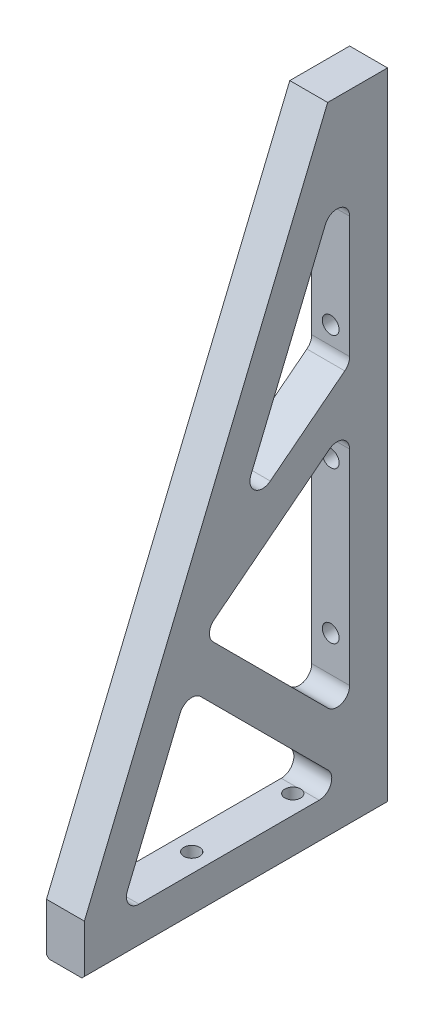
ISO-10303-21;
HEADER;
FILE_DESCRIPTION(('STEP AP214'),'2;1');
FILE_NAME('part.step','',(''),(''),'','','');
FILE_SCHEMA(('AUTOMOTIVE_DESIGN { 1 0 10303 214 1 1 1 1 }'));
ENDSEC;
DATA;
#1=APPLICATION_CONTEXT('core data for automotive mechanical design processes');
#2=APPLICATION_PROTOCOL_DEFINITION('international standard','automotive_design',2000,#1);
#3=PRODUCT_CONTEXT('',#1,'mechanical');
#4=PRODUCT('Part','Part','',(#3));
#5=PRODUCT_RELATED_PRODUCT_CATEGORY('part','',(#4));
#6=PRODUCT_DEFINITION_FORMATION('','',#4);
#7=PRODUCT_DEFINITION_CONTEXT('part definition',#1,'design');
#8=PRODUCT_DEFINITION('design','',#6,#7);
#9=PRODUCT_DEFINITION_SHAPE('','',#8);
#10=(LENGTH_UNIT() NAMED_UNIT(*) SI_UNIT(.MILLI.,.METRE.));
#11=(NAMED_UNIT(*) PLANE_ANGLE_UNIT() SI_UNIT($,.RADIAN.));
#12=(NAMED_UNIT(*) SI_UNIT($,.STERADIAN.) SOLID_ANGLE_UNIT());
#13=UNCERTAINTY_MEASURE_WITH_UNIT(LENGTH_MEASURE(1.E-05),#10,'distance_accuracy_value','');
#14=(GEOMETRIC_REPRESENTATION_CONTEXT(3) GLOBAL_UNCERTAINTY_ASSIGNED_CONTEXT((#13)) GLOBAL_UNIT_ASSIGNED_CONTEXT((#10,
#11,#12)) REPRESENTATION_CONTEXT('',''));
#15=CARTESIAN_POINT('',(0.,0.,0.));
#16=DIRECTION('',(0.,0.,1.));
#17=DIRECTION('',(1.,0.,0.));
#18=AXIS2_PLACEMENT_3D('',#15,#16,#17);
#19=CARTESIAN_POINT('',(9.52499999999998,25.3999999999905,139.7));
#20=DIRECTION('',(0.,-1.,0.));
#21=DIRECTION('',(0.,0.,-1.));
#22=AXIS2_PLACEMENT_3D('',#19,#20,#21);
#23=CONICAL_SURFACE('',#22,3.96874999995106,1.02974425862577);
#24=CARTESIAN_POINT('',(9.52499999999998,27.7846655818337,139.700000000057));
#25=VERTEX_POINT('',#24);
#26=VERTEX_LOOP('',#25);
#27=FACE_BOUND('',#26,.T.);
#28=CARTESIAN_POINT('',(9.52499999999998,25.4,139.7));
#29=DIRECTION('',(0.,-1.,0.));
#30=DIRECTION('',(0.,0.,-1.));
#31=AXIS2_PLACEMENT_3D('',#28,#29,#30);
#32=CIRCLE('',#31,3.96874999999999);
#33=CARTESIAN_POINT('',(9.52499999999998,25.4,135.73125));
#34=VERTEX_POINT('',#33);
#35=EDGE_CURVE('E244',#34,#34,#32,.T.);
#36=ORIENTED_EDGE('',*,*,#35,.T.);
#37=EDGE_LOOP('',(#36));
#38=FACE_BOUND('',#37,.T.);
#39=ADVANCED_FACE('F16',(#27,#38),#23,.F.);
#40=CARTESIAN_POINT('',(9.52499999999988,289.860909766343,22.2249999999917));
#41=DIRECTION('',(0.,0.,-1.));
#42=DIRECTION('',(-1.,0.,0.));
#43=AXIS2_PLACEMENT_3D('',#40,#41,#42);
#44=CONICAL_SURFACE('',#43,4.21640000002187,1.02974425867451);
#45=CARTESIAN_POINT('',(9.52499999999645,289.860909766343,24.7584687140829));
#46=VERTEX_POINT('',#45);
#47=VERTEX_LOOP('',#46);
#48=FACE_BOUND('',#47,.T.);
#49=CARTESIAN_POINT('',(9.52499999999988,289.860909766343,22.225));
#50=DIRECTION('',(0.,0.,-1.));
#51=DIRECTION('',(-1.,0.,0.));
#52=AXIS2_PLACEMENT_3D('',#49,#50,#51);
#53=CIRCLE('',#52,4.21639999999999);
#54=CARTESIAN_POINT('',(5.30859999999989,289.860909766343,22.225));
#55=VERTEX_POINT('',#54);
#56=EDGE_CURVE('E241',#55,#55,#53,.T.);
#57=ORIENTED_EDGE('',*,*,#56,.T.);
#58=EDGE_LOOP('',(#57));
#59=FACE_BOUND('',#58,.T.);
#60=ADVANCED_FACE('F614',(#48,#59),#44,.F.);
#61=CARTESIAN_POINT('',(9.52499999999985,9.52500000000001,22.2249999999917));
#62=DIRECTION('',(0.,0.,-1.));
#63=DIRECTION('',(-1.,0.,0.));
#64=AXIS2_PLACEMENT_3D('',#61,#62,#63);
#65=CONICAL_SURFACE('',#64,4.21640000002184,1.02974425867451);
#66=CARTESIAN_POINT('',(9.52499999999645,9.52500000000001,24.7584687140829));
#67=VERTEX_POINT('',#66);
#68=VERTEX_LOOP('',#67);
#69=FACE_BOUND('',#68,.T.);
#70=CARTESIAN_POINT('',(9.52499999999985,9.52500000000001,22.225));
#71=DIRECTION('',(0.,0.,-1.));
#72=DIRECTION('',(-1.,0.,0.));
#73=AXIS2_PLACEMENT_3D('',#70,#71,#72);
#74=CIRCLE('',#73,4.21639999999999);
#75=CARTESIAN_POINT('',(5.30859999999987,9.52500000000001,22.225));
#76=VERTEX_POINT('',#75);
#77=EDGE_CURVE('E238',#76,#76,#74,.T.);
#78=ORIENTED_EDGE('',*,*,#77,.T.);
#79=EDGE_LOOP('',(#78));
#80=FACE_BOUND('',#79,.T.);
#81=ADVANCED_FACE('F606',(#69,#80),#65,.F.);
#82=CARTESIAN_POINT('',(9.52499999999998,0.,139.7));
#83=DIRECTION('',(0.,-1.,0.));
#84=DIRECTION('',(0.,0.,-1.));
#85=AXIS2_PLACEMENT_3D('',#82,#83,#84);
#86=CYLINDRICAL_SURFACE('',#85,3.96874999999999);
#87=ORIENTED_EDGE('',*,*,#35,.F.);
#88=EDGE_LOOP('',(#87));
#89=FACE_BOUND('',#88,.T.);
#90=CARTESIAN_POINT('',(9.52499999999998,0.,139.7));
#91=DIRECTION('',(0.,-1.,0.));
#92=DIRECTION('',(0.,0.,-1.));
#93=AXIS2_PLACEMENT_3D('',#90,#91,#92);
#94=CIRCLE('',#93,3.96874999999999);
#95=CARTESIAN_POINT('',(9.52499999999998,0.,135.73125));
#96=VERTEX_POINT('',#95);
#97=EDGE_CURVE('E19',#96,#96,#94,.T.);
#98=ORIENTED_EDGE('',*,*,#97,.T.);
#99=EDGE_LOOP('',(#98));
#100=FACE_BOUND('',#99,.T.);
#101=ADVANCED_FACE('F603',(#89,#100),#86,.F.);
#102=CARTESIAN_POINT('',(9.52499999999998,0.,88.9));
#103=DIRECTION('',(0.,-1.,0.));
#104=DIRECTION('',(0.,0.,-1.));
#105=AXIS2_PLACEMENT_3D('',#102,#103,#104);
#106=CYLINDRICAL_SURFACE('',#105,3.96874999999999);
#107=CARTESIAN_POINT('',(9.52499999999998,19.05,88.9));
#108=DIRECTION('',(0.,-1.,0.));
#109=DIRECTION('',(0.,0.,-1.));
#110=AXIS2_PLACEMENT_3D('',#107,#108,#109);
#111=CIRCLE('',#110,3.96874999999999);
#112=CARTESIAN_POINT('',(9.52499999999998,19.05,84.93125));
#113=VERTEX_POINT('',#112);
#114=EDGE_CURVE('E225',#113,#113,#111,.F.);
#115=ORIENTED_EDGE('',*,*,#114,.T.);
#116=EDGE_LOOP('',(#115));
#117=FACE_BOUND('',#116,.T.);
#118=CARTESIAN_POINT('',(9.52499999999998,0.,88.9));
#119=DIRECTION('',(0.,-1.,0.));
#120=DIRECTION('',(0.,0.,-1.));
#121=AXIS2_PLACEMENT_3D('',#118,#119,#120);
#122=CIRCLE('',#121,3.96874999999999);
#123=CARTESIAN_POINT('',(9.52499999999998,0.,84.93125));
#124=VERTEX_POINT('',#123);
#125=EDGE_CURVE('E596',#124,#124,#122,.T.);
#126=ORIENTED_EDGE('',*,*,#125,.T.);
#127=EDGE_LOOP('',(#126));
#128=FACE_BOUND('',#127,.T.);
#129=ADVANCED_FACE('F385',(#117,#128),#106,.F.);
#130=CARTESIAN_POINT('',(9.52499999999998,0.,38.1));
#131=DIRECTION('',(0.,-1.,0.));
#132=DIRECTION('',(0.,0.,-1.));
#133=AXIS2_PLACEMENT_3D('',#130,#131,#132);
#134=CYLINDRICAL_SURFACE('',#133,3.96874999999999);
#135=CARTESIAN_POINT('',(9.52499999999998,19.05,38.1));
#136=DIRECTION('',(0.,-1.,0.));
#137=DIRECTION('',(0.,0.,-1.));
#138=AXIS2_PLACEMENT_3D('',#135,#136,#137);
#139=CIRCLE('',#138,3.96874999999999);
#140=CARTESIAN_POINT('',(8.14135190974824,19.05,34.3802561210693));
#141=VERTEX_POINT('',#140);
#142=CARTESIAN_POINT('',(10.9086480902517,19.05,34.3802561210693));
#143=VERTEX_POINT('',#142);
#144=EDGE_CURVE('E217',#141,#143,#139,.F.);
#145=ORIENTED_EDGE('',*,*,#144,.T.);
#146=CARTESIAN_POINT('',(10.9086480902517,19.05,34.3802561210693));
#147=CARTESIAN_POINT('',(10.7965351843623,19.0500251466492,34.3385359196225));
#148=CARTESIAN_POINT('',(10.6825276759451,19.0504124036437,34.3019149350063));
#149=CARTESIAN_POINT('',(10.4516857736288,19.0514844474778,34.2391059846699));
#150=CARTESIAN_POINT('',(10.3348516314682,19.0521692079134,34.2129170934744));
#151=CARTESIAN_POINT('',(10.1029098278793,19.0533907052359,34.1718390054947));
#152=CARTESIAN_POINT('',(9.98785907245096,19.0539313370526,34.1566279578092));
#153=CARTESIAN_POINT('',(9.75687217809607,19.0546780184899,34.1363337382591));
#154=CARTESIAN_POINT('',(9.64093608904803,19.0548840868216,34.13125));
#155=CARTESIAN_POINT('',(9.40906391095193,19.0548840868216,34.13125));
#156=CARTESIAN_POINT('',(9.29312782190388,19.0546780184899,34.1363337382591));
#157=CARTESIAN_POINT('',(9.06214092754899,19.0539313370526,34.1566279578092));
#158=CARTESIAN_POINT('',(8.94709017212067,19.0533907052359,34.1718390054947));
#159=CARTESIAN_POINT('',(8.71514836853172,19.0521692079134,34.2129170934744));
#160=CARTESIAN_POINT('',(8.59831422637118,19.0514844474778,34.2391059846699));
#161=CARTESIAN_POINT('',(8.36747232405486,19.0504124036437,34.3019149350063));
#162=CARTESIAN_POINT('',(8.25346481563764,19.0500251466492,34.3385359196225));
#163=CARTESIAN_POINT('',(8.14135190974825,19.05,34.3802561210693));
#164=B_SPLINE_CURVE_WITH_KNOTS('',3,(#146,#147,#148,#149,#150,#151,#152,#153,#154,#155,#156,
#157,#158,#159,#160,#161,#162,#163),.UNSPECIFIED.,.F.,.F.,(4,2,2,2,2,2,2,2,4),(0.,
0.358746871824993,0.717461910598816,1.06517797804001,1.41287459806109,1.76057121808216,
2.10828728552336,2.46700232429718,2.82574919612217),.UNSPECIFIED.);
#165=EDGE_CURVE('E205',#143,#141,#164,.T.);
#166=ORIENTED_EDGE('',*,*,#165,.T.);
#167=EDGE_LOOP('',(#145,#166));
#168=FACE_BOUND('',#167,.T.);
#169=CARTESIAN_POINT('',(9.52499999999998,0.,38.1));
#170=DIRECTION('',(0.,-1.,0.));
#171=DIRECTION('',(0.,0.,-1.));
#172=AXIS2_PLACEMENT_3D('',#169,#170,#171);
#173=CIRCLE('',#172,3.96874999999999);
#174=CARTESIAN_POINT('',(9.52499999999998,0.,34.13125));
#175=VERTEX_POINT('',#174);
#176=EDGE_CURVE('E568',#175,#175,#173,.T.);
#177=ORIENTED_EDGE('',*,*,#176,.T.);
#178=EDGE_LOOP('',(#177));
#179=FACE_BOUND('',#178,.T.);
#180=ADVANCED_FACE('F342',(#168,#179),#134,.F.);
#181=CARTESIAN_POINT('',(9.52499999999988,213.580885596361,0.));
#182=DIRECTION('',(0.,0.,-1.));
#183=DIRECTION('',(-1.,0.,0.));
#184=AXIS2_PLACEMENT_3D('',#181,#182,#183);
#185=CYLINDRICAL_SURFACE('',#184,4.21639999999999);
#186=CARTESIAN_POINT('',(9.52499999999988,213.580885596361,19.05));
#187=DIRECTION('',(0.,0.,-1.));
#188=DIRECTION('',(-1.,0.,0.));
#189=AXIS2_PLACEMENT_3D('',#186,#187,#188);
#190=CIRCLE('',#189,4.21639999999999);
#191=CARTESIAN_POINT('',(5.30859999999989,213.580885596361,19.05));
#192=VERTEX_POINT('',#191);
#193=EDGE_CURVE('E305',#192,#192,#190,.F.);
#194=ORIENTED_EDGE('',*,*,#193,.T.);
#195=EDGE_LOOP('',(#194));
#196=FACE_BOUND('',#195,.T.);
#197=CARTESIAN_POINT('',(9.52499999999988,213.580885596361,0.));
#198=DIRECTION('',(0.,0.,-1.));
#199=DIRECTION('',(-1.,0.,0.));
#200=AXIS2_PLACEMENT_3D('',#197,#198,#199);
#201=CIRCLE('',#200,4.21639999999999);
#202=CARTESIAN_POINT('',(5.30859999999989,213.580885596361,0.));
#203=VERTEX_POINT('',#202);
#204=EDGE_CURVE('E293',#203,#203,#201,.T.);
#205=ORIENTED_EDGE('',*,*,#204,.T.);
#206=EDGE_LOOP('',(#205));
#207=FACE_BOUND('',#206,.T.);
#208=ADVANCED_FACE('F377',(#196,#207),#185,.F.);
#209=CARTESIAN_POINT('',(9.52499999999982,155.575,0.));
#210=DIRECTION('',(0.,0.,-1.));
#211=DIRECTION('',(-1.,0.,0.));
#212=AXIS2_PLACEMENT_3D('',#209,#210,#211);
#213=CYLINDRICAL_SURFACE('',#212,4.21639999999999);
#214=CARTESIAN_POINT('',(9.52499999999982,155.575,19.05));
#215=DIRECTION('',(0.,0.,-1.));
#216=DIRECTION('',(-1.,0.,0.));
#217=AXIS2_PLACEMENT_3D('',#214,#215,#216);
#218=CIRCLE('',#217,4.21639999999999);
#219=CARTESIAN_POINT('',(5.30859999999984,155.575,19.05));
#220=VERTEX_POINT('',#219);
#221=EDGE_CURVE('E320',#220,#220,#218,.F.);
#222=ORIENTED_EDGE('',*,*,#221,.T.);
#223=EDGE_LOOP('',(#222));
#224=FACE_BOUND('',#223,.T.);
#225=CARTESIAN_POINT('',(9.52499999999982,155.575,0.));
#226=DIRECTION('',(0.,0.,-1.));
#227=DIRECTION('',(-1.,0.,0.));
#228=AXIS2_PLACEMENT_3D('',#225,#226,#227);
#229=CIRCLE('',#228,4.21639999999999);
#230=CARTESIAN_POINT('',(5.30859999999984,155.575,0.));
#231=VERTEX_POINT('',#230);
#232=EDGE_CURVE('E290',#231,#231,#229,.T.);
#233=ORIENTED_EDGE('',*,*,#232,.T.);
#234=EDGE_LOOP('',(#233));
#235=FACE_BOUND('',#234,.T.);
#236=ADVANCED_FACE('F374',(#224,#235),#213,.F.);
#237=CARTESIAN_POINT('',(9.52499999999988,289.860909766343,0.));
#238=DIRECTION('',(0.,0.,-1.));
#239=DIRECTION('',(-1.,0.,0.));
#240=AXIS2_PLACEMENT_3D('',#237,#238,#239);
#241=CYLINDRICAL_SURFACE('',#240,4.21639999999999);
#242=ORIENTED_EDGE('',*,*,#56,.F.);
#243=EDGE_LOOP('',(#242));
#244=FACE_BOUND('',#243,.T.);
#245=CARTESIAN_POINT('',(9.52499999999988,289.860909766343,0.));
#246=DIRECTION('',(0.,0.,-1.));
#247=DIRECTION('',(-1.,0.,0.));
#248=AXIS2_PLACEMENT_3D('',#245,#246,#247);
#249=CIRCLE('',#248,4.21639999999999);
#250=CARTESIAN_POINT('',(5.30859999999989,289.860909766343,0.));
#251=VERTEX_POINT('',#250);
#252=EDGE_CURVE('E287',#251,#251,#249,.T.);
#253=ORIENTED_EDGE('',*,*,#252,.T.);
#254=EDGE_LOOP('',(#253));
#255=FACE_BOUND('',#254,.T.);
#256=ADVANCED_FACE('F370',(#244,#255),#241,.F.);
#257=CARTESIAN_POINT('',(9.52499999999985,9.52500000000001,0.));
#258=DIRECTION('',(0.,0.,-1.));
#259=DIRECTION('',(-1.,0.,0.));
#260=AXIS2_PLACEMENT_3D('',#257,#258,#259);
#261=CYLINDRICAL_SURFACE('',#260,4.21639999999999);
#262=ORIENTED_EDGE('',*,*,#77,.F.);
#263=EDGE_LOOP('',(#262));
#264=FACE_BOUND('',#263,.T.);
#265=CARTESIAN_POINT('',(9.52499999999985,9.52500000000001,0.));
#266=DIRECTION('',(0.,0.,-1.));
#267=DIRECTION('',(-1.,0.,0.));
#268=AXIS2_PLACEMENT_3D('',#265,#266,#267);
#269=CIRCLE('',#268,4.21639999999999);
#270=CARTESIAN_POINT('',(5.30859999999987,9.52500000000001,0.));
#271=VERTEX_POINT('',#270);
#272=EDGE_CURVE('E284',#271,#271,#269,.T.);
#273=ORIENTED_EDGE('',*,*,#272,.T.);
#274=EDGE_LOOP('',(#273));
#275=FACE_BOUND('',#274,.T.);
#276=ADVANCED_FACE('F366',(#264,#275),#261,.F.);
#277=CARTESIAN_POINT('',(9.52499999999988,79.375,0.));
#278=DIRECTION('',(0.,0.,-1.));
#279=DIRECTION('',(-1.,0.,0.));
#280=AXIS2_PLACEMENT_3D('',#277,#278,#279);
#281=CYLINDRICAL_SURFACE('',#280,4.21639999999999);
#282=CARTESIAN_POINT('',(9.52499999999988,79.375,19.05));
#283=DIRECTION('',(0.,0.,-1.));
#284=DIRECTION('',(-1.,0.,0.));
#285=AXIS2_PLACEMENT_3D('',#282,#283,#284);
#286=CIRCLE('',#285,4.21639999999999);
#287=CARTESIAN_POINT('',(5.30859999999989,79.375,19.05));
#288=VERTEX_POINT('',#287);
#289=EDGE_CURVE('E316',#288,#288,#286,.F.);
#290=ORIENTED_EDGE('',*,*,#289,.T.);
#291=EDGE_LOOP('',(#290));
#292=FACE_BOUND('',#291,.T.);
#293=CARTESIAN_POINT('',(9.52499999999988,79.375,0.));
#294=DIRECTION('',(0.,0.,-1.));
#295=DIRECTION('',(-1.,0.,0.));
#296=AXIS2_PLACEMENT_3D('',#293,#294,#295);
#297=CIRCLE('',#296,4.21639999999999);
#298=CARTESIAN_POINT('',(5.30859999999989,79.375,0.));
#299=VERTEX_POINT('',#298);
#300=EDGE_CURVE('E280',#299,#299,#297,.T.);
#301=ORIENTED_EDGE('',*,*,#300,.T.);
#302=EDGE_LOOP('',(#301));
#303=FACE_BOUND('',#302,.T.);
#304=ADVANCED_FACE('F362',(#292,#303),#281,.F.);
#305=CARTESIAN_POINT('',(19.05,0.,0.));
#306=DIRECTION('',(0.,1.,0.));
#307=DIRECTION('',(0.,0.,1.));
#308=AXIS2_PLACEMENT_3D('',#305,#306,#307);
#309=PLANE('',#308);
#310=DIRECTION('',(0.,0.,1.));
#311=VECTOR('',#310,1.);
#312=CARTESIAN_POINT('',(1.27,0.,0.));
#313=LINE('',#312,#311);
#314=CARTESIAN_POINT('',(1.27,0.,0.));
#315=VERTEX_POINT('',#314);
#316=CARTESIAN_POINT('',(1.27,0.,152.4));
#317=VERTEX_POINT('',#316);
#318=EDGE_CURVE('E566',#315,#317,#313,.T.);
#319=ORIENTED_EDGE('',*,*,#318,.F.);
#320=DIRECTION('',(1.,0.,0.));
#321=VECTOR('',#320,1.);
#322=CARTESIAN_POINT('',(19.05,0.,0.));
#323=LINE('',#322,#321);
#324=CARTESIAN_POINT('',(17.78,0.,0.));
#325=VERTEX_POINT('',#324);
#326=EDGE_CURVE('E513',#315,#325,#323,.T.);
#327=ORIENTED_EDGE('',*,*,#326,.T.);
#328=DIRECTION('',(0.,0.,1.));
#329=VECTOR('',#328,1.);
#330=CARTESIAN_POINT('',(17.78,0.,0.));
#331=LINE('',#330,#329);
#332=CARTESIAN_POINT('',(17.78,0.,152.4));
#333=VERTEX_POINT('',#332);
#334=EDGE_CURVE('E508',#325,#333,#331,.T.);
#335=ORIENTED_EDGE('',*,*,#334,.T.);
#336=DIRECTION('',(-1.,0.,0.));
#337=VECTOR('',#336,1.);
#338=CARTESIAN_POINT('',(19.05,0.,152.4));
#339=LINE('',#338,#337);
#340=EDGE_CURVE('E501',#333,#317,#339,.T.);
#341=ORIENTED_EDGE('',*,*,#340,.T.);
#342=EDGE_LOOP('',(#319,#327,#335,#341));
#343=FACE_BOUND('',#342,.T.);
#344=ORIENTED_EDGE('',*,*,#176,.F.);
#345=EDGE_LOOP('',(#344));
#346=FACE_BOUND('',#345,.T.);
#347=ORIENTED_EDGE('',*,*,#125,.F.);
#348=EDGE_LOOP('',(#347));
#349=FACE_BOUND('',#348,.T.);
#350=ORIENTED_EDGE('',*,*,#97,.F.);
#351=EDGE_LOOP('',(#350));
#352=FACE_BOUND('',#351,.T.);
#353=ADVANCED_FACE('F358',(#343,#346,#349,#352),#309,.F.);
#354=CARTESIAN_POINT('',(1.26999999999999,0.,0.));
#355=DIRECTION('',(-0.707106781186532,-0.707106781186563,0.));
#356=DIRECTION('',(0.707106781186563,-0.707106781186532,0.));
#357=AXIS2_PLACEMENT_3D('',#354,#355,#356);
#358=PLANE('',#357);
#359=DIRECTION('',(0.707106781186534,-0.707106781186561,0.));
#360=VECTOR('',#359,1.);
#361=CARTESIAN_POINT('',(0.,1.27000000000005,0.));
#362=LINE('',#361,#360);
#363=CARTESIAN_POINT('',(0.,1.26999999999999,0.));
#364=VERTEX_POINT('',#363);
#365=EDGE_CURVE('E515',#364,#315,#362,.T.);
#366=ORIENTED_EDGE('',*,*,#365,.T.);
#367=ORIENTED_EDGE('',*,*,#318,.T.);
#368=DIRECTION('',(-0.707106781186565,0.70710678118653,0.));
#369=VECTOR('',#368,1.);
#370=CARTESIAN_POINT('',(1.27,0.,152.4));
#371=LINE('',#370,#369);
#372=CARTESIAN_POINT('',(0.,1.26999999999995,152.4));
#373=VERTEX_POINT('',#372);
#374=EDGE_CURVE('E498',#317,#373,#371,.T.);
#375=ORIENTED_EDGE('',*,*,#374,.T.);
#376=DIRECTION('',(0.,0.,1.));
#377=VECTOR('',#376,1.);
#378=CARTESIAN_POINT('',(0.,1.27000000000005,0.));
#379=LINE('',#378,#377);
#380=EDGE_CURVE('E206',#364,#373,#379,.T.);
#381=ORIENTED_EDGE('',*,*,#380,.F.);
#382=EDGE_LOOP('',(#366,#367,#375,#381));
#383=FACE_BOUND('',#382,.T.);
#384=ADVANCED_FACE('F354',(#383),#358,.T.);
#385=CARTESIAN_POINT('',(0.,0.,0.));
#386=DIRECTION('',(-1.,0.,0.));
#387=DIRECTION('',(0.,0.,1.));
#388=AXIS2_PLACEMENT_3D('',#385,#386,#387);
#389=PLANE('',#388);
#390=DIRECTION('',(0.,0.923879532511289,-0.382683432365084));
#391=VECTOR('',#390,1.);
#392=CARTESIAN_POINT('',(0.,25.4,152.4));
#393=LINE('',#392,#391);
#394=CARTESIAN_POINT('',(0.,25.4,152.4));
#395=VERTEX_POINT('',#394);
#396=CARTESIAN_POINT('',(0.,320.675,30.0930903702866));
#397=VERTEX_POINT('',#396);
#398=EDGE_CURVE('E527',#395,#397,#393,.T.);
#399=ORIENTED_EDGE('',*,*,#398,.T.);
#400=DIRECTION('',(0.,0.,-1.));
#401=VECTOR('',#400,1.);
#402=CARTESIAN_POINT('',(0.,320.675,30.0930903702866));
#403=LINE('',#402,#401);
#404=CARTESIAN_POINT('',(0.,320.675,0.));
#405=VERTEX_POINT('',#404);
#406=EDGE_CURVE('E296',#397,#405,#403,.T.);
#407=ORIENTED_EDGE('',*,*,#406,.T.);
#408=DIRECTION('',(0.,1.,0.));
#409=VECTOR('',#408,1.);
#410=CARTESIAN_POINT('',(0.,320.675,0.));
#411=LINE('',#410,#409);
#412=EDGE_CURVE('E518',#405,#364,#411,.F.);
#413=ORIENTED_EDGE('',*,*,#412,.T.);
#414=ORIENTED_EDGE('',*,*,#380,.T.);
#415=DIRECTION('',(0.,1.,0.));
#416=VECTOR('',#415,1.);
#417=CARTESIAN_POINT('',(0.,0.,152.4));
#418=LINE('',#417,#416);
#419=EDGE_CURVE('E279',#373,#395,#418,.T.);
#420=ORIENTED_EDGE('',*,*,#419,.T.);
#421=EDGE_LOOP('',(#399,#407,#413,#414,#420));
#422=FACE_BOUND('',#421,.T.);
#423=DIRECTION('',(0.,0.61566147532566,-0.788010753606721));
#424=VECTOR('',#423,1.);
#425=CARTESIAN_POINT('',(0.,155.413717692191,77.9269834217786));
#426=LINE('',#425,#424);
#427=CARTESIAN_POINT('',(0.,170.262850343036,58.9209603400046));
#428=VERTEX_POINT('',#427);
#429=CARTESIAN_POINT('',(0.,199.506692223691,21.4905496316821));
#430=VERTEX_POINT('',#429);
#431=EDGE_CURVE('E529',#428,#430,#426,.T.);
#432=ORIENTED_EDGE('',*,*,#431,.T.);
#433=CARTESIAN_POINT('',(0.,204.510560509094,25.4));
#434=DIRECTION('',(-1.,0.,0.));
#435=DIRECTION('',(0.,0.,1.));
#436=AXIS2_PLACEMENT_3D('',#433,#434,#435);
#437=CIRCLE('',#436,6.35);
#438=CARTESIAN_POINT('',(0.,204.510560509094,19.05));
#439=VERTEX_POINT('',#438);
#440=EDGE_CURVE('E309',#430,#439,#437,.F.);
#441=ORIENTED_EDGE('',*,*,#440,.T.);
#442=DIRECTION('',(0.,1.,0.));
#443=VECTOR('',#442,1.);
#444=CARTESIAN_POINT('',(0.,201.413458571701,19.05));
#445=LINE('',#444,#443);
#446=CARTESIAN_POINT('',(0.,265.631723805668,19.05));
#447=VERTEX_POINT('',#446);
#448=EDGE_CURVE('E542',#439,#447,#445,.T.);
#449=ORIENTED_EDGE('',*,*,#448,.T.);
#450=CARTESIAN_POINT('',(0.,265.631723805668,25.4));
#451=DIRECTION('',(-1.,0.,0.));
#452=DIRECTION('',(0.,0.,1.));
#453=AXIS2_PLACEMENT_3D('',#450,#451,#452);
#454=CIRCLE('',#453,6.35);
#455=CARTESIAN_POINT('',(0.,268.061763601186,31.2666350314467));
#456=VERTEX_POINT('',#455);
#457=EDGE_CURVE('E301',#447,#456,#454,.F.);
#458=ORIENTED_EDGE('',*,*,#457,.T.);
#459=DIRECTION('',(0.,-0.923879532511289,0.382683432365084));
#460=VECTOR('',#459,1.);
#461=CARTESIAN_POINT('',(0.,297.555329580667,19.05));
#462=LINE('',#461,#460);
#463=CARTESIAN_POINT('',(0.,177.696758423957,68.6970457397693));
#464=VERTEX_POINT('',#463);
#465=EDGE_CURVE('E537',#456,#464,#462,.T.);
#466=ORIENTED_EDGE('',*,*,#465,.T.);
#467=CARTESIAN_POINT('',(0.,175.266718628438,62.8304107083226));
#468=DIRECTION('',(-1.,0.,0.));
#469=DIRECTION('',(0.,0.,1.));
#470=AXIS2_PLACEMENT_3D('',#467,#468,#469);
#471=CIRCLE('',#470,6.34999999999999);
#472=EDGE_CURVE('E297',#464,#428,#471,.F.);
#473=ORIENTED_EDGE('',*,*,#472,.T.);
#474=EDGE_LOOP('',(#432,#441,#449,#458,#466,#473));
#475=FACE_BOUND('',#474,.T.);
#476=DIRECTION('',(0.,-0.61566147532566,0.788010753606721));
#477=VECTOR('',#476,1.);
#478=CARTESIAN_POINT('',(0.,119.672322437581,92.7315540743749));
#479=LINE('',#478,#477);
#480=CARTESIAN_POINT('',(0.,169.223100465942,29.3094503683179));
#481=VERTEX_POINT('',#480);
#482=CARTESIAN_POINT('',(0.,124.091152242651,87.0757098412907));
#483=VERTEX_POINT('',#482);
#484=EDGE_CURVE('E311',#481,#483,#479,.T.);
#485=ORIENTED_EDGE('',*,*,#484,.T.);
#486=CARTESIAN_POINT('',(0.,119.087283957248,83.1662594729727));
#487=DIRECTION('',(-1.,0.,0.));
#488=DIRECTION('',(0.,0.,1.));
#489=AXIS2_PLACEMENT_3D('',#486,#487,#488);
#490=CIRCLE('',#489,6.34999999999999);
#491=CARTESIAN_POINT('',(0.,114.597155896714,87.6563875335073));
#492=VERTEX_POINT('',#491);
#493=EDGE_CURVE('E326',#483,#492,#490,.F.);
#494=ORIENTED_EDGE('',*,*,#493,.T.);
#495=DIRECTION('',(0.,-0.707106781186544,-0.707106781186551));
#496=VECTOR('',#495,1.);
#497=CARTESIAN_POINT('',(0.,45.9907683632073,19.05));
#498=LINE('',#497,#496);
#499=CARTESIAN_POINT('',(0.,56.8308964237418,29.8901280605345));
#500=VERTEX_POINT('',#499);
#501=EDGE_CURVE('E229',#492,#500,#498,.T.);
#502=ORIENTED_EDGE('',*,*,#501,.T.);
#503=CARTESIAN_POINT('',(0.,61.3210244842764,25.4));
#504=DIRECTION('',(-1.,0.,0.));
#505=DIRECTION('',(0.,0.,1.));
#506=AXIS2_PLACEMENT_3D('',#503,#504,#505);
#507=CIRCLE('',#506,6.35);
#508=CARTESIAN_POINT('',(0.,61.3210244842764,19.05));
#509=VERTEX_POINT('',#508);
#510=EDGE_CURVE('E323',#500,#509,#507,.F.);
#511=ORIENTED_EDGE('',*,*,#510,.T.);
#512=DIRECTION('',(0.,1.,0.));
#513=VECTOR('',#512,1.);
#514=CARTESIAN_POINT('',(0.,177.238661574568,19.05));
#515=LINE('',#514,#513);
#516=CARTESIAN_POINT('',(0.,164.21923218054,19.05));
#517=VERTEX_POINT('',#516);
#518=EDGE_CURVE('E552',#509,#517,#515,.T.);
#519=ORIENTED_EDGE('',*,*,#518,.T.);
#520=CARTESIAN_POINT('',(0.,164.21923218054,25.4));
#521=DIRECTION('',(-1.,0.,0.));
#522=DIRECTION('',(0.,0.,1.));
#523=AXIS2_PLACEMENT_3D('',#520,#521,#522);
#524=CIRCLE('',#523,6.35);
#525=EDGE_CURVE('E312',#517,#481,#524,.F.);
#526=ORIENTED_EDGE('',*,*,#525,.T.);
#527=EDGE_LOOP('',(#485,#494,#502,#511,#519,#526));
#528=FACE_BOUND('',#527,.T.);
#529=DIRECTION('',(0.,0.,-1.));
#530=VECTOR('',#529,1.);
#531=CARTESIAN_POINT('',(0.,19.05,134.410684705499));
#532=LINE('',#531,#530);
#533=CARTESIAN_POINT('',(0.,19.05,124.907238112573));
#534=VERTEX_POINT('',#533);
#535=CARTESIAN_POINT('',(0.,19.05,34.3802561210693));
#536=VERTEX_POINT('',#535);
#537=EDGE_CURVE('E213',#534,#536,#532,.T.);
#538=ORIENTED_EDGE('',*,*,#537,.T.);
#539=CARTESIAN_POINT('',(0.,25.4,34.3802561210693));
#540=DIRECTION('',(-1.,0.,0.));
#541=DIRECTION('',(0.,0.,1.));
#542=AXIS2_PLACEMENT_3D('',#539,#540,#541);
#543=CIRCLE('',#542,6.35);
#544=CARTESIAN_POINT('',(0.,29.8901280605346,29.8901280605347));
#545=VERTEX_POINT('',#544);
#546=EDGE_CURVE('E196',#536,#545,#543,.F.);
#547=ORIENTED_EDGE('',*,*,#546,.T.);
#548=DIRECTION('',(0.,0.707106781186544,0.707106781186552));
#549=VECTOR('',#548,1.);
#550=CARTESIAN_POINT('',(0.,19.05,19.05));
#551=LINE('',#550,#549);
#552=CARTESIAN_POINT('',(0.,93.9023709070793,93.9023709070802));
#553=VERTEX_POINT('',#552);
#554=EDGE_CURVE('E235',#545,#553,#551,.T.);
#555=ORIENTED_EDGE('',*,*,#554,.T.);
#556=CARTESIAN_POINT('',(0.,89.4122428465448,98.3924989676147));
#557=DIRECTION('',(-1.,0.,0.));
#558=DIRECTION('',(0.,0.,1.));
#559=AXIS2_PLACEMENT_3D('',#556,#557,#558);
#560=CIRCLE('',#559,6.34999999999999);
#561=CARTESIAN_POINT('',(0.,91.842282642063,104.259133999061));
#562=VERTEX_POINT('',#561);
#563=EDGE_CURVE('E334',#553,#562,#560,.F.);
#564=ORIENTED_EDGE('',*,*,#563,.T.);
#565=DIRECTION('',(0.,-0.923879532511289,0.382683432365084));
#566=VECTOR('',#565,1.);
#567=CARTESIAN_POINT('',(0.,100.622322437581,100.622322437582));
#568=LINE('',#567,#566);
#569=CARTESIAN_POINT('',(0.,27.8300397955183,130.77387314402));
#570=VERTEX_POINT('',#569);
#571=EDGE_CURVE('E231',#562,#570,#568,.T.);
#572=ORIENTED_EDGE('',*,*,#571,.T.);
#573=CARTESIAN_POINT('',(0.,25.4,124.907238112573));
#574=DIRECTION('',(-1.,0.,0.));
#575=DIRECTION('',(0.,0.,1.));
#576=AXIS2_PLACEMENT_3D('',#573,#574,#575);
#577=CIRCLE('',#576,6.34999999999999);
#578=EDGE_CURVE('E222',#570,#534,#577,.F.);
#579=ORIENTED_EDGE('',*,*,#578,.T.);
#580=EDGE_LOOP('',(#538,#547,#555,#564,#572,#579));
#581=FACE_BOUND('',#580,.T.);
#582=ADVANCED_FACE('F220',(#422,#475,#528,#581),#389,.T.);
#583=CARTESIAN_POINT('',(-0.001000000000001,25.4,34.3802561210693));
#584=DIRECTION('',(-1.,0.,0.));
#585=DIRECTION('',(0.,0.,1.));
#586=AXIS2_PLACEMENT_3D('',#583,#584,#585);
#587=CYLINDRICAL_SURFACE('',#586,6.35);
#588=ORIENTED_EDGE('',*,*,#165,.F.);
#589=DIRECTION('',(1.,0.,0.));
#590=VECTOR('',#589,1.);
#591=CARTESIAN_POINT('',(-0.001000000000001,19.05,34.3802561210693));
#592=LINE('',#591,#590);
#593=CARTESIAN_POINT('',(19.05,19.05,34.3802561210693));
#594=VERTEX_POINT('',#593);
#595=EDGE_CURVE('E329',#143,#594,#592,.T.);
#596=ORIENTED_EDGE('',*,*,#595,.T.);
#597=CARTESIAN_POINT('',(19.05,25.4,34.3802561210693));
#598=DIRECTION('',(-1.,0.,0.));
#599=DIRECTION('',(0.,0.,1.));
#600=AXIS2_PLACEMENT_3D('',#597,#598,#599);
#601=CIRCLE('',#600,6.35);
#602=CARTESIAN_POINT('',(19.05,29.8901280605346,29.8901280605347));
#603=VERTEX_POINT('',#602);
#604=EDGE_CURVE('E277',#594,#603,#601,.F.);
#605=ORIENTED_EDGE('',*,*,#604,.T.);
#606=DIRECTION('',(1.,0.,0.));
#607=VECTOR('',#606,1.);
#608=CARTESIAN_POINT('',(-0.001000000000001,29.8901280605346,29.8901280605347));
#609=LINE('',#608,#607);
#610=EDGE_CURVE('E201',#603,#545,#609,.F.);
#611=ORIENTED_EDGE('',*,*,#610,.T.);
#612=ORIENTED_EDGE('',*,*,#546,.F.);
#613=DIRECTION('',(1.,0.,0.));
#614=VECTOR('',#613,1.);
#615=CARTESIAN_POINT('',(-0.001000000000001,19.05,34.3802561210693));
#616=LINE('',#615,#614);
#617=EDGE_CURVE('E199',#536,#141,#616,.T.);
#618=ORIENTED_EDGE('',*,*,#617,.T.);
#619=EDGE_LOOP('',(#588,#596,#605,#611,#612,#618));
#620=FACE_BOUND('',#619,.T.);
#621=ADVANCED_FACE('F198',(#620),#587,.F.);
#622=CARTESIAN_POINT('',(-0.001000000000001,19.05,19.05));
#623=DIRECTION('',(0.,0.707106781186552,-0.707106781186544));
#624=DIRECTION('',(0.,0.707106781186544,0.707106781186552));
#625=AXIS2_PLACEMENT_3D('',#622,#623,#624);
#626=PLANE('',#625);
#627=ORIENTED_EDGE('',*,*,#610,.F.);
#628=DIRECTION('',(0.,0.707106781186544,0.707106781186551));
#629=VECTOR('',#628,1.);
#630=CARTESIAN_POINT('',(19.05,29.8901280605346,29.8901280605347));
#631=LINE('',#630,#629);
#632=CARTESIAN_POINT('',(19.05,93.9023709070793,93.9023709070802));
#633=VERTEX_POINT('',#632);
#634=EDGE_CURVE('E276',#603,#633,#631,.T.);
#635=ORIENTED_EDGE('',*,*,#634,.T.);
#636=DIRECTION('',(-1.,0.,0.));
#637=VECTOR('',#636,1.);
#638=CARTESIAN_POINT('',(-0.001000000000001,93.9023709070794,93.9023709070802));
#639=LINE('',#638,#637);
#640=EDGE_CURVE('E237',#633,#553,#639,.T.);
#641=ORIENTED_EDGE('',*,*,#640,.T.);
#642=ORIENTED_EDGE('',*,*,#554,.F.);
#643=EDGE_LOOP('',(#627,#635,#641,#642));
#644=FACE_BOUND('',#643,.T.);
#645=ADVANCED_FACE('F350',(#644),#626,.F.);
#646=CARTESIAN_POINT('',(-0.001000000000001,89.4122428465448,98.3924989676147));
#647=DIRECTION('',(-1.,0.,0.));
#648=DIRECTION('',(0.,0.,1.));
#649=AXIS2_PLACEMENT_3D('',#646,#647,#648);
#650=CYLINDRICAL_SURFACE('',#649,6.34999999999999);
#651=ORIENTED_EDGE('',*,*,#640,.F.);
#652=CARTESIAN_POINT('',(19.05,89.4122428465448,98.3924989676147));
#653=DIRECTION('',(-1.,0.,0.));
#654=DIRECTION('',(0.,0.,1.));
#655=AXIS2_PLACEMENT_3D('',#652,#653,#654);
#656=CIRCLE('',#655,6.34999999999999);
#657=CARTESIAN_POINT('',(19.05,91.842282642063,104.259133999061));
#658=VERTEX_POINT('',#657);
#659=EDGE_CURVE('E273',#633,#658,#656,.F.);
#660=ORIENTED_EDGE('',*,*,#659,.T.);
#661=DIRECTION('',(1.,0.,0.));
#662=VECTOR('',#661,1.);
#663=CARTESIAN_POINT('',(-0.001000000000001,91.842282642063,104.259133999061));
#664=LINE('',#663,#662);
#665=EDGE_CURVE('E234',#658,#562,#664,.F.);
#666=ORIENTED_EDGE('',*,*,#665,.T.);
#667=ORIENTED_EDGE('',*,*,#563,.F.);
#668=EDGE_LOOP('',(#651,#660,#666,#667));
#669=FACE_BOUND('',#668,.T.);
#670=ADVANCED_FACE('F472',(#669),#650,.F.);
#671=CARTESIAN_POINT('',(-0.001000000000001,100.622322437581,100.622322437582));
#672=DIRECTION('',(0.,0.382683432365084,0.923879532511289));
#673=DIRECTION('',(0.,-0.923879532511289,0.382683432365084));
#674=AXIS2_PLACEMENT_3D('',#671,#672,#673);
#675=PLANE('',#674);
#676=ORIENTED_EDGE('',*,*,#665,.F.);
#677=DIRECTION('',(0.,-0.923879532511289,0.382683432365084));
#678=VECTOR('',#677,1.);
#679=CARTESIAN_POINT('',(19.05,91.842282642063,104.259133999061));
#680=LINE('',#679,#678);
#681=CARTESIAN_POINT('',(19.05,27.8300397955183,130.77387314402));
#682=VERTEX_POINT('',#681);
#683=EDGE_CURVE('E272',#658,#682,#680,.T.);
#684=ORIENTED_EDGE('',*,*,#683,.T.);
#685=DIRECTION('',(-1.,0.,0.));
#686=VECTOR('',#685,1.);
#687=CARTESIAN_POINT('',(-0.001000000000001,27.8300397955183,130.77387314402));
#688=LINE('',#687,#686);
#689=EDGE_CURVE('E233',#682,#570,#688,.T.);
#690=ORIENTED_EDGE('',*,*,#689,.T.);
#691=ORIENTED_EDGE('',*,*,#571,.F.);
#692=EDGE_LOOP('',(#676,#684,#690,#691));
#693=FACE_BOUND('',#692,.T.);
#694=ADVANCED_FACE('F469',(#693),#675,.F.);
#695=CARTESIAN_POINT('',(-0.001000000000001,25.4,124.907238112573));
#696=DIRECTION('',(-1.,0.,0.));
#697=DIRECTION('',(0.,0.,1.));
#698=AXIS2_PLACEMENT_3D('',#695,#696,#697);
#699=CYLINDRICAL_SURFACE('',#698,6.34999999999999);
#700=CARTESIAN_POINT('',(19.05,25.4,124.907238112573));
#701=DIRECTION('',(-1.,0.,0.));
#702=DIRECTION('',(0.,0.,1.));
#703=AXIS2_PLACEMENT_3D('',#700,#701,#702);
#704=CIRCLE('',#703,6.34999999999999);
#705=CARTESIAN_POINT('',(19.05,19.05,124.907238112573));
#706=VERTEX_POINT('',#705);
#707=EDGE_CURVE('E270',#682,#706,#704,.F.);
#708=ORIENTED_EDGE('',*,*,#707,.T.);
#709=DIRECTION('',(1.,0.,0.));
#710=VECTOR('',#709,1.);
#711=CARTESIAN_POINT('',(-0.001000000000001,19.05,124.907238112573));
#712=LINE('',#711,#710);
#713=EDGE_CURVE('E223',#706,#534,#712,.F.);
#714=ORIENTED_EDGE('',*,*,#713,.T.);
#715=ORIENTED_EDGE('',*,*,#578,.F.);
#716=ORIENTED_EDGE('',*,*,#689,.F.);
#717=EDGE_LOOP('',(#708,#714,#715,#716));
#718=FACE_BOUND('',#717,.T.);
#719=ADVANCED_FACE('F466',(#718),#699,.F.);
#720=CARTESIAN_POINT('',(-0.001000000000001,19.05,134.410684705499));
#721=DIRECTION('',(0.,-1.,0.));
#722=DIRECTION('',(0.,0.,-1.));
#723=AXIS2_PLACEMENT_3D('',#720,#721,#722);
#724=PLANE('',#723);
#725=ORIENTED_EDGE('',*,*,#144,.F.);
#726=ORIENTED_EDGE('',*,*,#617,.F.);
#727=ORIENTED_EDGE('',*,*,#537,.F.);
#728=ORIENTED_EDGE('',*,*,#713,.F.);
#729=DIRECTION('',(0.,0.,1.));
#730=VECTOR('',#729,1.);
#731=CARTESIAN_POINT('',(19.05,19.05,0.));
#732=LINE('',#731,#730);
#733=EDGE_CURVE('E269',#706,#594,#732,.F.);
#734=ORIENTED_EDGE('',*,*,#733,.T.);
#735=ORIENTED_EDGE('',*,*,#595,.F.);
#736=EDGE_LOOP('',(#725,#726,#727,#728,#734,#735));
#737=FACE_BOUND('',#736,.T.);
#738=ORIENTED_EDGE('',*,*,#114,.F.);
#739=EDGE_LOOP('',(#738));
#740=FACE_BOUND('',#739,.T.);
#741=ADVANCED_FACE('F210',(#737,#740),#724,.F.);
#742=CARTESIAN_POINT('',(-0.001000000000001,119.087283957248,83.1662594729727));
#743=DIRECTION('',(-1.,0.,0.));
#744=DIRECTION('',(0.,0.,1.));
#745=AXIS2_PLACEMENT_3D('',#742,#743,#744);
#746=CYLINDRICAL_SURFACE('',#745,6.34999999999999);
#747=CARTESIAN_POINT('',(19.05,119.087283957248,83.1662594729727));
#748=DIRECTION('',(-1.,0.,0.));
#749=DIRECTION('',(0.,0.,1.));
#750=AXIS2_PLACEMENT_3D('',#747,#748,#749);
#751=CIRCLE('',#750,6.34999999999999);
#752=CARTESIAN_POINT('',(19.05,124.091152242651,87.0757098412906));
#753=VERTEX_POINT('',#752);
#754=CARTESIAN_POINT('',(19.05,114.597155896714,87.6563875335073));
#755=VERTEX_POINT('',#754);
#756=EDGE_CURVE('E267',#753,#755,#751,.F.);
#757=ORIENTED_EDGE('',*,*,#756,.T.);
#758=DIRECTION('',(1.,0.,0.));
#759=VECTOR('',#758,1.);
#760=CARTESIAN_POINT('',(-0.001000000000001,114.597155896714,87.6563875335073));
#761=LINE('',#760,#759);
#762=EDGE_CURVE('E328',#755,#492,#761,.F.);
#763=ORIENTED_EDGE('',*,*,#762,.T.);
#764=ORIENTED_EDGE('',*,*,#493,.F.);
#765=DIRECTION('',(1.,0.,0.));
#766=VECTOR('',#765,1.);
#767=CARTESIAN_POINT('',(-0.001000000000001,124.091152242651,87.0757098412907));
#768=LINE('',#767,#766);
#769=EDGE_CURVE('E314',#483,#753,#768,.T.);
#770=ORIENTED_EDGE('',*,*,#769,.T.);
#771=EDGE_LOOP('',(#757,#763,#764,#770));
#772=FACE_BOUND('',#771,.T.);
#773=ADVANCED_FACE('F459',(#772),#746,.F.);
#774=CARTESIAN_POINT('',(-0.001000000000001,45.9907683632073,19.05));
#775=DIRECTION('',(0.,-0.707106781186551,0.707106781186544));
#776=DIRECTION('',(0.,-0.707106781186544,-0.707106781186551));
#777=AXIS2_PLACEMENT_3D('',#774,#775,#776);
#778=PLANE('',#777);
#779=DIRECTION('',(-1.,0.,0.));
#780=VECTOR('',#779,1.);
#781=CARTESIAN_POINT('',(-0.001000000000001,56.8308964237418,29.8901280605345));
#782=LINE('',#781,#780);
#783=CARTESIAN_POINT('',(19.05,56.8308964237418,29.8901280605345));
#784=VERTEX_POINT('',#783);
#785=EDGE_CURVE('E325',#784,#500,#782,.T.);
#786=ORIENTED_EDGE('',*,*,#785,.T.);
#787=ORIENTED_EDGE('',*,*,#501,.F.);
#788=ORIENTED_EDGE('',*,*,#762,.F.);
#789=DIRECTION('',(0.,-0.707106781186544,-0.707106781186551));
#790=VECTOR('',#789,1.);
#791=CARTESIAN_POINT('',(19.05,114.597155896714,87.6563875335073));
#792=LINE('',#791,#790);
#793=EDGE_CURVE('E266',#755,#784,#792,.T.);
#794=ORIENTED_EDGE('',*,*,#793,.T.);
#795=EDGE_LOOP('',(#786,#787,#788,#794));
#796=FACE_BOUND('',#795,.T.);
#797=ADVANCED_FACE('F455',(#796),#778,.F.);
#798=CARTESIAN_POINT('',(-0.001000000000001,61.3210244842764,25.4));
#799=DIRECTION('',(-1.,0.,0.));
#800=DIRECTION('',(0.,0.,1.));
#801=AXIS2_PLACEMENT_3D('',#798,#799,#800);
#802=CYLINDRICAL_SURFACE('',#801,6.35);
#803=ORIENTED_EDGE('',*,*,#785,.F.);
#804=CARTESIAN_POINT('',(19.05,61.3210244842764,25.4));
#805=DIRECTION('',(-1.,0.,0.));
#806=DIRECTION('',(0.,0.,1.));
#807=AXIS2_PLACEMENT_3D('',#804,#805,#806);
#808=CIRCLE('',#807,6.35);
#809=CARTESIAN_POINT('',(19.05,61.3210244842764,19.05));
#810=VERTEX_POINT('',#809);
#811=EDGE_CURVE('E263',#784,#810,#808,.F.);
#812=ORIENTED_EDGE('',*,*,#811,.T.);
#813=DIRECTION('',(1.,0.,0.));
#814=VECTOR('',#813,1.);
#815=CARTESIAN_POINT('',(-0.001000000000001,61.3210244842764,19.05));
#816=LINE('',#815,#814);
#817=EDGE_CURVE('E319',#810,#509,#816,.F.);
#818=ORIENTED_EDGE('',*,*,#817,.T.);
#819=ORIENTED_EDGE('',*,*,#510,.F.);
#820=EDGE_LOOP('',(#803,#812,#818,#819));
#821=FACE_BOUND('',#820,.T.);
#822=ADVANCED_FACE('F451',(#821),#802,.F.);
#823=CARTESIAN_POINT('',(-0.001000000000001,177.238661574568,19.05));
#824=DIRECTION('',(0.,0.,-1.));
#825=DIRECTION('',(0.,1.,0.));
#826=AXIS2_PLACEMENT_3D('',#823,#824,#825);
#827=PLANE('',#826);
#828=ORIENTED_EDGE('',*,*,#817,.F.);
#829=DIRECTION('',(0.,1.,0.));
#830=VECTOR('',#829,1.);
#831=CARTESIAN_POINT('',(19.05,0.,19.05));
#832=LINE('',#831,#830);
#833=CARTESIAN_POINT('',(19.05,164.21923218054,19.05));
#834=VERTEX_POINT('',#833);
#835=EDGE_CURVE('E262',#810,#834,#832,.T.);
#836=ORIENTED_EDGE('',*,*,#835,.T.);
#837=DIRECTION('',(-1.,0.,0.));
#838=VECTOR('',#837,1.);
#839=CARTESIAN_POINT('',(-0.001000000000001,164.21923218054,19.05));
#840=LINE('',#839,#838);
#841=EDGE_CURVE('E315',#834,#517,#840,.T.);
#842=ORIENTED_EDGE('',*,*,#841,.T.);
#843=ORIENTED_EDGE('',*,*,#518,.F.);
#844=EDGE_LOOP('',(#828,#836,#842,#843));
#845=FACE_BOUND('',#844,.T.);
#846=ORIENTED_EDGE('',*,*,#289,.F.);
#847=EDGE_LOOP('',(#846));
#848=FACE_BOUND('',#847,.T.);
#849=ORIENTED_EDGE('',*,*,#221,.F.);
#850=EDGE_LOOP('',(#849));
#851=FACE_BOUND('',#850,.T.);
#852=ADVANCED_FACE('F447',(#845,#848,#851),#827,.F.);
#853=CARTESIAN_POINT('',(-0.001000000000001,164.21923218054,25.4));
#854=DIRECTION('',(-1.,0.,0.));
#855=DIRECTION('',(0.,0.,1.));
#856=AXIS2_PLACEMENT_3D('',#853,#854,#855);
#857=CYLINDRICAL_SURFACE('',#856,6.35);
#858=ORIENTED_EDGE('',*,*,#841,.F.);
#859=CARTESIAN_POINT('',(19.05,164.21923218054,25.4));
#860=DIRECTION('',(-1.,0.,0.));
#861=DIRECTION('',(0.,0.,1.));
#862=AXIS2_PLACEMENT_3D('',#859,#860,#861);
#863=CIRCLE('',#862,6.35);
#864=CARTESIAN_POINT('',(19.05,169.223100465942,29.3094503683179));
#865=VERTEX_POINT('',#864);
#866=EDGE_CURVE('E259',#834,#865,#863,.F.);
#867=ORIENTED_EDGE('',*,*,#866,.T.);
#868=DIRECTION('',(1.,0.,0.));
#869=VECTOR('',#868,1.);
#870=CARTESIAN_POINT('',(-0.001000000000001,169.223100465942,29.3094503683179));
#871=LINE('',#870,#869);
#872=EDGE_CURVE('E545',#865,#481,#871,.F.);
#873=ORIENTED_EDGE('',*,*,#872,.T.);
#874=ORIENTED_EDGE('',*,*,#525,.F.);
#875=EDGE_LOOP('',(#858,#867,#873,#874));
#876=FACE_BOUND('',#875,.T.);
#877=ADVANCED_FACE('F443',(#876),#857,.F.);
#878=CARTESIAN_POINT('',(-0.001000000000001,119.672322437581,92.7315540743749));
#879=DIRECTION('',(0.,0.788010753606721,0.61566147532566));
#880=DIRECTION('',(0.,-0.61566147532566,0.788010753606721));
#881=AXIS2_PLACEMENT_3D('',#878,#879,#880);
#882=PLANE('',#881);
#883=ORIENTED_EDGE('',*,*,#872,.F.);
#884=DIRECTION('',(0.,-0.615661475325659,0.788010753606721));
#885=VECTOR('',#884,1.);
#886=CARTESIAN_POINT('',(19.05,169.223100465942,29.3094503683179));
#887=LINE('',#886,#885);
#888=EDGE_CURVE('E258',#865,#753,#887,.T.);
#889=ORIENTED_EDGE('',*,*,#888,.T.);
#890=ORIENTED_EDGE('',*,*,#769,.F.);
#891=ORIENTED_EDGE('',*,*,#484,.F.);
#892=EDGE_LOOP('',(#883,#889,#890,#891));
#893=FACE_BOUND('',#892,.T.);
#894=ADVANCED_FACE('F439',(#893),#882,.F.);
#895=CARTESIAN_POINT('',(-0.001000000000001,204.510560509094,25.4));
#896=DIRECTION('',(-1.,0.,0.));
#897=DIRECTION('',(0.,0.,1.));
#898=AXIS2_PLACEMENT_3D('',#895,#896,#897);
#899=CYLINDRICAL_SURFACE('',#898,6.35);
#900=DIRECTION('',(1.,0.,0.));
#901=VECTOR('',#900,1.);
#902=CARTESIAN_POINT('',(-0.001000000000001,199.506692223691,21.4905496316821));
#903=LINE('',#902,#901);
#904=CARTESIAN_POINT('',(19.05,199.506692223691,21.4905496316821));
#905=VERTEX_POINT('',#904);
#906=EDGE_CURVE('E299',#430,#905,#903,.T.);
#907=ORIENTED_EDGE('',*,*,#906,.T.);
#908=CARTESIAN_POINT('',(19.05,204.510560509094,25.4));
#909=DIRECTION('',(-1.,0.,0.));
#910=DIRECTION('',(0.,0.,1.));
#911=AXIS2_PLACEMENT_3D('',#908,#909,#910);
#912=CIRCLE('',#911,6.35);
#913=CARTESIAN_POINT('',(19.05,204.510560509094,19.05));
#914=VERTEX_POINT('',#913);
#915=EDGE_CURVE('E255',#905,#914,#912,.F.);
#916=ORIENTED_EDGE('',*,*,#915,.T.);
#917=DIRECTION('',(1.,0.,0.));
#918=VECTOR('',#917,1.);
#919=CARTESIAN_POINT('',(-0.001000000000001,204.510560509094,19.05));
#920=LINE('',#919,#918);
#921=EDGE_CURVE('E308',#914,#439,#920,.F.);
#922=ORIENTED_EDGE('',*,*,#921,.T.);
#923=ORIENTED_EDGE('',*,*,#440,.F.);
#924=EDGE_LOOP('',(#907,#916,#922,#923));
#925=FACE_BOUND('',#924,.T.);
#926=ADVANCED_FACE('F435',(#925),#899,.F.);
#927=CARTESIAN_POINT('',(-0.001000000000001,201.413458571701,19.05));
#928=DIRECTION('',(0.,0.,-1.));
#929=DIRECTION('',(0.,1.,0.));
#930=AXIS2_PLACEMENT_3D('',#927,#928,#929);
#931=PLANE('',#930);
#932=ORIENTED_EDGE('',*,*,#921,.F.);
#933=DIRECTION('',(0.,1.,0.));
#934=VECTOR('',#933,1.);
#935=CARTESIAN_POINT('',(19.05,0.,19.05));
#936=LINE('',#935,#934);
#937=CARTESIAN_POINT('',(19.05,265.631723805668,19.05));
#938=VERTEX_POINT('',#937);
#939=EDGE_CURVE('E254',#914,#938,#936,.T.);
#940=ORIENTED_EDGE('',*,*,#939,.T.);
#941=DIRECTION('',(-1.,0.,0.));
#942=VECTOR('',#941,1.);
#943=CARTESIAN_POINT('',(-0.001000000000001,265.631723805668,19.05));
#944=LINE('',#943,#942);
#945=EDGE_CURVE('E304',#938,#447,#944,.T.);
#946=ORIENTED_EDGE('',*,*,#945,.T.);
#947=ORIENTED_EDGE('',*,*,#448,.F.);
#948=EDGE_LOOP('',(#932,#940,#946,#947));
#949=FACE_BOUND('',#948,.T.);
#950=ORIENTED_EDGE('',*,*,#193,.F.);
#951=EDGE_LOOP('',(#950));
#952=FACE_BOUND('',#951,.T.);
#953=ADVANCED_FACE('F431',(#949,#952),#931,.F.);
#954=CARTESIAN_POINT('',(-0.001000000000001,265.631723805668,25.4));
#955=DIRECTION('',(-1.,0.,0.));
#956=DIRECTION('',(0.,0.,1.));
#957=AXIS2_PLACEMENT_3D('',#954,#955,#956);
#958=CYLINDRICAL_SURFACE('',#957,6.35);
#959=ORIENTED_EDGE('',*,*,#945,.F.);
#960=CARTESIAN_POINT('',(19.05,265.631723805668,25.4));
#961=DIRECTION('',(-1.,0.,0.));
#962=DIRECTION('',(0.,0.,1.));
#963=AXIS2_PLACEMENT_3D('',#960,#961,#962);
#964=CIRCLE('',#963,6.35);
#965=CARTESIAN_POINT('',(19.05,268.061763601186,31.2666350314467));
#966=VERTEX_POINT('',#965);
#967=EDGE_CURVE('E251',#938,#966,#964,.F.);
#968=ORIENTED_EDGE('',*,*,#967,.T.);
#969=DIRECTION('',(1.,0.,0.));
#970=VECTOR('',#969,1.);
#971=CARTESIAN_POINT('',(-0.001000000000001,268.061763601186,31.2666350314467));
#972=LINE('',#971,#970);
#973=EDGE_CURVE('E303',#966,#456,#972,.F.);
#974=ORIENTED_EDGE('',*,*,#973,.T.);
#975=ORIENTED_EDGE('',*,*,#457,.F.);
#976=EDGE_LOOP('',(#959,#968,#974,#975));
#977=FACE_BOUND('',#976,.T.);
#978=ADVANCED_FACE('F427',(#977),#958,.F.);
#979=CARTESIAN_POINT('',(-0.001000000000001,297.555329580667,19.05));
#980=DIRECTION('',(0.,0.382683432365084,0.923879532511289));
#981=DIRECTION('',(0.,-0.923879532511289,0.382683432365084));
#982=AXIS2_PLACEMENT_3D('',#979,#980,#981);
#983=PLANE('',#982);
#984=DIRECTION('',(-1.,0.,0.));
#985=VECTOR('',#984,1.);
#986=CARTESIAN_POINT('',(-0.001000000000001,177.696758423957,68.6970457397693));
#987=LINE('',#986,#985);
#988=CARTESIAN_POINT('',(19.05,177.696758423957,68.6970457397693));
#989=VERTEX_POINT('',#988);
#990=EDGE_CURVE('E300',#989,#464,#987,.T.);
#991=ORIENTED_EDGE('',*,*,#990,.T.);
#992=ORIENTED_EDGE('',*,*,#465,.F.);
#993=ORIENTED_EDGE('',*,*,#973,.F.);
#994=DIRECTION('',(0.,-0.923879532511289,0.382683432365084));
#995=VECTOR('',#994,1.);
#996=CARTESIAN_POINT('',(19.05,268.061763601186,31.2666350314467));
#997=LINE('',#996,#995);
#998=EDGE_CURVE('E250',#966,#989,#997,.T.);
#999=ORIENTED_EDGE('',*,*,#998,.T.);
#1000=EDGE_LOOP('',(#991,#992,#993,#999));
#1001=FACE_BOUND('',#1000,.T.);
#1002=ADVANCED_FACE('F423',(#1001),#983,.F.);
#1003=CARTESIAN_POINT('',(-0.001000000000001,175.266718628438,62.8304107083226));
#1004=DIRECTION('',(-1.,0.,0.));
#1005=DIRECTION('',(0.,0.,1.));
#1006=AXIS2_PLACEMENT_3D('',#1003,#1004,#1005);
#1007=CYLINDRICAL_SURFACE('',#1006,6.34999999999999);
#1008=CARTESIAN_POINT('',(19.05,175.266718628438,62.8304107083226));
#1009=DIRECTION('',(-1.,0.,0.));
#1010=DIRECTION('',(0.,0.,1.));
#1011=AXIS2_PLACEMENT_3D('',#1008,#1009,#1010);
#1012=CIRCLE('',#1011,6.34999999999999);
#1013=CARTESIAN_POINT('',(19.05,170.262850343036,58.9209603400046));
#1014=VERTEX_POINT('',#1013);
#1015=EDGE_CURVE('E247',#989,#1014,#1012,.F.);
#1016=ORIENTED_EDGE('',*,*,#1015,.T.);
#1017=DIRECTION('',(1.,0.,0.));
#1018=VECTOR('',#1017,1.);
#1019=CARTESIAN_POINT('',(-0.001000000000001,170.262850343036,58.9209603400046));
#1020=LINE('',#1019,#1018);
#1021=EDGE_CURVE('E530',#1014,#428,#1020,.F.);
#1022=ORIENTED_EDGE('',*,*,#1021,.T.);
#1023=ORIENTED_EDGE('',*,*,#472,.F.);
#1024=ORIENTED_EDGE('',*,*,#990,.F.);
#1025=EDGE_LOOP('',(#1016,#1022,#1023,#1024));
#1026=FACE_BOUND('',#1025,.T.);
#1027=ADVANCED_FACE('F419',(#1026),#1007,.F.);
#1028=CARTESIAN_POINT('',(-0.001000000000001,155.413717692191,77.9269834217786));
#1029=DIRECTION('',(0.,-0.788010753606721,-0.61566147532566));
#1030=DIRECTION('',(0.,0.61566147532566,-0.788010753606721));
#1031=AXIS2_PLACEMENT_3D('',#1028,#1029,#1030);
#1032=PLANE('',#1031);
#1033=ORIENTED_EDGE('',*,*,#1021,.F.);
#1034=DIRECTION('',(0.,0.61566147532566,-0.788010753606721));
#1035=VECTOR('',#1034,1.);
#1036=CARTESIAN_POINT('',(19.05,170.262850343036,58.9209603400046));
#1037=LINE('',#1036,#1035);
#1038=EDGE_CURVE('E249',#1014,#905,#1037,.T.);
#1039=ORIENTED_EDGE('',*,*,#1038,.T.);
#1040=ORIENTED_EDGE('',*,*,#906,.F.);
#1041=ORIENTED_EDGE('',*,*,#431,.F.);
#1042=EDGE_LOOP('',(#1033,#1039,#1040,#1041));
#1043=FACE_BOUND('',#1042,.T.);
#1044=ADVANCED_FACE('F415',(#1043),#1032,.F.);
#1045=CARTESIAN_POINT('',(19.05,25.4,152.4));
#1046=DIRECTION('',(0.,-0.382683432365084,-0.923879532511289));
#1047=DIRECTION('',(0.,0.923879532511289,-0.382683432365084));
#1048=AXIS2_PLACEMENT_3D('',#1045,#1046,#1047);
#1049=PLANE('',#1048);
#1050=DIRECTION('',(-1.,0.,0.));
#1051=VECTOR('',#1050,1.);
#1052=CARTESIAN_POINT('',(19.05,25.4,152.4));
#1053=LINE('',#1052,#1051);
#1054=CARTESIAN_POINT('',(19.05,25.4,152.4));
#1055=VERTEX_POINT('',#1054);
#1056=EDGE_CURVE('E505',#395,#1055,#1053,.F.);
#1057=ORIENTED_EDGE('',*,*,#1056,.T.);
#1058=DIRECTION('',(0.,0.923879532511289,-0.382683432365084));
#1059=VECTOR('',#1058,1.);
#1060=CARTESIAN_POINT('',(19.05,25.4,152.4));
#1061=LINE('',#1060,#1059);
#1062=CARTESIAN_POINT('',(19.05,320.675,30.0930903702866));
#1063=VERTEX_POINT('',#1062);
#1064=EDGE_CURVE('E885',#1055,#1063,#1061,.T.);
#1065=ORIENTED_EDGE('',*,*,#1064,.T.);
#1066=DIRECTION('',(1.,0.,0.));
#1067=VECTOR('',#1066,1.);
#1068=CARTESIAN_POINT('',(19.05,320.675,30.0930903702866));
#1069=LINE('',#1068,#1067);
#1070=EDGE_CURVE('E524',#1063,#397,#1069,.F.);
#1071=ORIENTED_EDGE('',*,*,#1070,.T.);
#1072=ORIENTED_EDGE('',*,*,#398,.F.);
#1073=EDGE_LOOP('',(#1057,#1065,#1071,#1072));
#1074=FACE_BOUND('',#1073,.T.);
#1075=ADVANCED_FACE('F411',(#1074),#1049,.F.);
#1076=CARTESIAN_POINT('',(19.05,320.675,30.0930903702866));
#1077=DIRECTION('',(0.,-1.,0.));
#1078=DIRECTION('',(0.,0.,-1.));
#1079=AXIS2_PLACEMENT_3D('',#1076,#1077,#1078);
#1080=PLANE('',#1079);
#1081=ORIENTED_EDGE('',*,*,#1070,.F.);
#1082=DIRECTION('',(0.,0.,1.));
#1083=VECTOR('',#1082,1.);
#1084=CARTESIAN_POINT('',(19.05,320.675,0.));
#1085=LINE('',#1084,#1083);
#1086=CARTESIAN_POINT('',(19.05,320.675,0.));
#1087=VERTEX_POINT('',#1086);
#1088=EDGE_CURVE('E888',#1063,#1087,#1085,.F.);
#1089=ORIENTED_EDGE('',*,*,#1088,.T.);
#1090=DIRECTION('',(1.,0.,0.));
#1091=VECTOR('',#1090,1.);
#1092=CARTESIAN_POINT('',(19.05,320.675,0.));
#1093=LINE('',#1092,#1091);
#1094=EDGE_CURVE('E283',#1087,#405,#1093,.F.);
#1095=ORIENTED_EDGE('',*,*,#1094,.T.);
#1096=ORIENTED_EDGE('',*,*,#406,.F.);
#1097=EDGE_LOOP('',(#1081,#1089,#1095,#1096));
#1098=FACE_BOUND('',#1097,.T.);
#1099=ADVANCED_FACE('F407',(#1098),#1080,.F.);
#1100=CARTESIAN_POINT('',(19.05,320.675,0.));
#1101=DIRECTION('',(0.,0.,1.));
#1102=DIRECTION('',(1.,0.,0.));
#1103=AXIS2_PLACEMENT_3D('',#1100,#1101,#1102);
#1104=PLANE('',#1103);
#1105=ORIENTED_EDGE('',*,*,#365,.F.);
#1106=ORIENTED_EDGE('',*,*,#412,.F.);
#1107=ORIENTED_EDGE('',*,*,#1094,.F.);
#1108=DIRECTION('',(0.,1.,0.));
#1109=VECTOR('',#1108,1.);
#1110=CARTESIAN_POINT('',(19.05,0.,0.));
#1111=LINE('',#1110,#1109);
#1112=CARTESIAN_POINT('',(19.05,1.27000000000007,0.));
#1113=VERTEX_POINT('',#1112);
#1114=EDGE_CURVE('E891',#1087,#1113,#1111,.F.);
#1115=ORIENTED_EDGE('',*,*,#1114,.T.);
#1116=DIRECTION('',(-0.707106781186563,-0.707106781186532,0.));
#1117=VECTOR('',#1116,1.);
#1118=CARTESIAN_POINT('',(19.05,1.26999999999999,0.));
#1119=LINE('',#1118,#1117);
#1120=EDGE_CURVE('E510',#1113,#325,#1119,.T.);
#1121=ORIENTED_EDGE('',*,*,#1120,.T.);
#1122=ORIENTED_EDGE('',*,*,#326,.F.);
#1123=EDGE_LOOP('',(#1105,#1106,#1107,#1115,#1121,#1122));
#1124=FACE_BOUND('',#1123,.T.);
#1125=ORIENTED_EDGE('',*,*,#300,.F.);
#1126=EDGE_LOOP('',(#1125));
#1127=FACE_BOUND('',#1126,.T.);
#1128=ORIENTED_EDGE('',*,*,#272,.F.);
#1129=EDGE_LOOP('',(#1128));
#1130=FACE_BOUND('',#1129,.T.);
#1131=ORIENTED_EDGE('',*,*,#252,.F.);
#1132=EDGE_LOOP('',(#1131));
#1133=FACE_BOUND('',#1132,.T.);
#1134=ORIENTED_EDGE('',*,*,#232,.F.);
#1135=EDGE_LOOP('',(#1134));
#1136=FACE_BOUND('',#1135,.T.);
#1137=ORIENTED_EDGE('',*,*,#204,.F.);
#1138=EDGE_LOOP('',(#1137));
#1139=FACE_BOUND('',#1138,.T.);
#1140=ADVANCED_FACE('F403',(#1124,#1127,#1130,#1133,#1136,#1139),#1104,.F.);
#1141=CARTESIAN_POINT('',(19.05,1.26999999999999,0.));
#1142=DIRECTION('',(-0.707106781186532,0.707106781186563,0.));
#1143=DIRECTION('',(-0.707106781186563,-0.707106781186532,0.));
#1144=AXIS2_PLACEMENT_3D('',#1141,#1142,#1143);
#1145=PLANE('',#1144);
#1146=ORIENTED_EDGE('',*,*,#334,.F.);
#1147=ORIENTED_EDGE('',*,*,#1120,.F.);
#1148=DIRECTION('',(0.,0.,1.));
#1149=VECTOR('',#1148,1.);
#1150=CARTESIAN_POINT('',(19.05,1.2700000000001,0.));
#1151=LINE('',#1150,#1149);
#1152=CARTESIAN_POINT('',(19.05,1.27000000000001,152.4));
#1153=VERTEX_POINT('',#1152);
#1154=EDGE_CURVE('E25',#1113,#1153,#1151,.T.);
#1155=ORIENTED_EDGE('',*,*,#1154,.T.);
#1156=DIRECTION('',(-0.707106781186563,-0.707106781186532,0.));
#1157=VECTOR('',#1156,1.);
#1158=CARTESIAN_POINT('',(19.05,1.26999999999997,152.4));
#1159=LINE('',#1158,#1157);
#1160=EDGE_CURVE('E33',#1153,#333,#1159,.T.);
#1161=ORIENTED_EDGE('',*,*,#1160,.T.);
#1162=EDGE_LOOP('',(#1146,#1147,#1155,#1161));
#1163=FACE_BOUND('',#1162,.T.);
#1164=ADVANCED_FACE('F396',(#1163),#1145,.F.);
#1165=CARTESIAN_POINT('',(19.05,0.,152.4));
#1166=DIRECTION('',(0.,0.,-1.));
#1167=DIRECTION('',(-1.,0.,0.));
#1168=AXIS2_PLACEMENT_3D('',#1165,#1166,#1167);
#1169=PLANE('',#1168);
#1170=ORIENTED_EDGE('',*,*,#374,.F.);
#1171=ORIENTED_EDGE('',*,*,#340,.F.);
#1172=ORIENTED_EDGE('',*,*,#1160,.F.);
#1173=DIRECTION('',(0.,1.,0.));
#1174=VECTOR('',#1173,1.);
#1175=CARTESIAN_POINT('',(19.05,0.,152.4));
#1176=LINE('',#1175,#1174);
#1177=EDGE_CURVE('E11',#1153,#1055,#1176,.T.);
#1178=ORIENTED_EDGE('',*,*,#1177,.T.);
#1179=ORIENTED_EDGE('',*,*,#1056,.F.);
#1180=ORIENTED_EDGE('',*,*,#419,.F.);
#1181=EDGE_LOOP('',(#1170,#1171,#1172,#1178,#1179,#1180));
#1182=FACE_BOUND('',#1181,.T.);
#1183=ADVANCED_FACE('F390',(#1182),#1169,.F.);
#1184=CARTESIAN_POINT('',(19.05,0.,0.));
#1185=DIRECTION('',(-1.,0.,0.));
#1186=DIRECTION('',(0.,0.,1.));
#1187=AXIS2_PLACEMENT_3D('',#1184,#1185,#1186);
#1188=PLANE('',#1187);
#1189=ORIENTED_EDGE('',*,*,#1154,.F.);
#1190=ORIENTED_EDGE('',*,*,#1114,.F.);
#1191=ORIENTED_EDGE('',*,*,#1088,.F.);
#1192=ORIENTED_EDGE('',*,*,#1064,.F.);
#1193=ORIENTED_EDGE('',*,*,#1177,.F.);
#1194=EDGE_LOOP('',(#1189,#1190,#1191,#1192,#1193));
#1195=FACE_BOUND('',#1194,.T.);
#1196=ORIENTED_EDGE('',*,*,#1038,.F.);
#1197=ORIENTED_EDGE('',*,*,#1015,.F.);
#1198=ORIENTED_EDGE('',*,*,#998,.F.);
#1199=ORIENTED_EDGE('',*,*,#967,.F.);
#1200=ORIENTED_EDGE('',*,*,#939,.F.);
#1201=ORIENTED_EDGE('',*,*,#915,.F.);
#1202=EDGE_LOOP('',(#1196,#1197,#1198,#1199,#1200,#1201));
#1203=FACE_BOUND('',#1202,.T.);
#1204=ORIENTED_EDGE('',*,*,#866,.F.);
#1205=ORIENTED_EDGE('',*,*,#835,.F.);
#1206=ORIENTED_EDGE('',*,*,#811,.F.);
#1207=ORIENTED_EDGE('',*,*,#793,.F.);
#1208=ORIENTED_EDGE('',*,*,#756,.F.);
#1209=ORIENTED_EDGE('',*,*,#888,.F.);
#1210=EDGE_LOOP('',(#1204,#1205,#1206,#1207,#1208,#1209));
#1211=FACE_BOUND('',#1210,.T.);
#1212=ORIENTED_EDGE('',*,*,#733,.F.);
#1213=ORIENTED_EDGE('',*,*,#707,.F.);
#1214=ORIENTED_EDGE('',*,*,#683,.F.);
#1215=ORIENTED_EDGE('',*,*,#659,.F.);
#1216=ORIENTED_EDGE('',*,*,#634,.F.);
#1217=ORIENTED_EDGE('',*,*,#604,.F.);
#1218=EDGE_LOOP('',(#1212,#1213,#1214,#1215,#1216,#1217));
#1219=FACE_BOUND('',#1218,.T.);
#1220=ADVANCED_FACE('F388',(#1195,#1203,#1211,#1219),#1188,.F.);
#1221=CLOSED_SHELL('',(#39,#60,#81,#101,#129,#180,#208,#236,#256,#276,#304,#353,#384,#582,#621,
#645,#670,#694,#719,#741,#773,#797,#822,#852,#877,#894,#926,#953,#978,#1002,#1027,#1044,#1075,
#1099,#1140,#1164,#1183,#1220));
#1222=MANIFOLD_SOLID_BREP('B1',#1221);
#1223=ADVANCED_BREP_SHAPE_REPRESENTATION('',(#18,#1222),#14);
#1224=SHAPE_DEFINITION_REPRESENTATION(#9,#1223);
ENDSEC;
END-ISO-10303-21;
